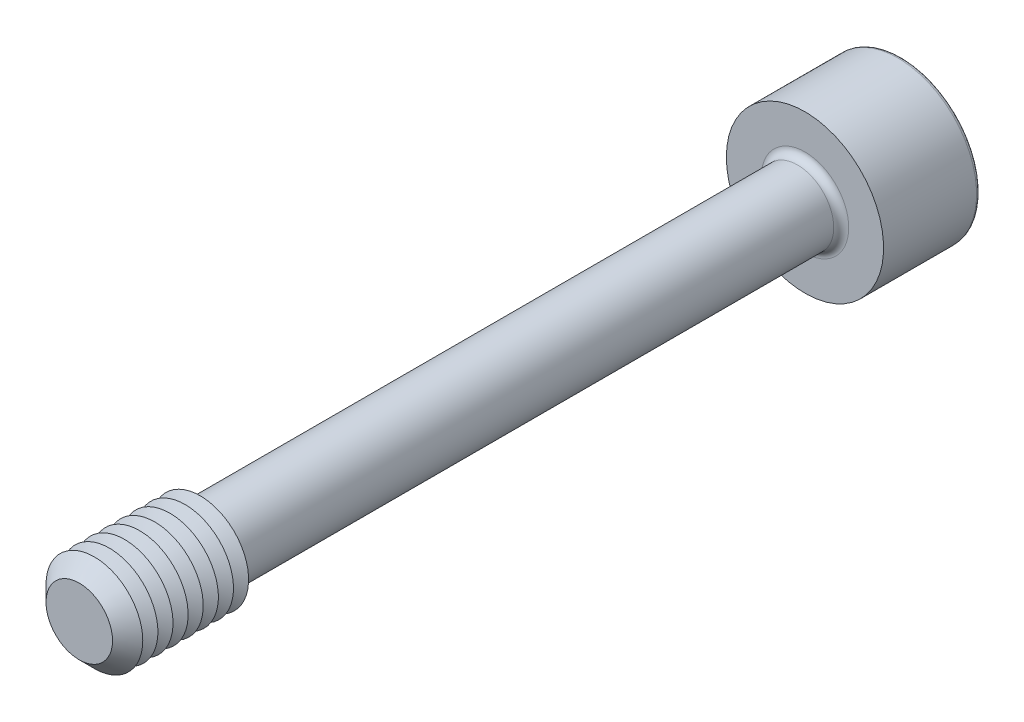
from build123d import *

# Parameters (mm, degrees)
SKETCH1_R       = 3
EXTRUDE1_DEPTH  = 30
CHAMFER1_SIZE   = 1.25
SKETCH3_R       = 6.5
EXTRUDE2_DEPTH  = 8
EXTRUDE3_DEPTH  = 6
FILLET1_R       = 0.62
FILLET2_R       = 0.31
LPATTERN1_COUNT = 7
LPATTERN1_PITCH = 1.25


with BuildPart() as part:
    # Sketch1 → Extrude1 (new, symmetric)
    with BuildSketch(Plane.XY):
        Circle(SKETCH1_R)
    extrude(amount=EXTRUDE1_DEPTH, both=True)

    # Sketch2 → Revolve1 (revolve)
    with BuildSketch(Plane(origin=(0, 0, 0), x_dir=(0, 0, -1), z_dir=(1, 0, 0))):
        Polygon((-30, 0), (-30, 4), (-20, 4), (-19.422649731, 3), (-19.422649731, 0), align=None)
    revolve(axis=Axis((0, 0, 19.422649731), (0, 0, 1)))

    # Chamfer1
    chamfer1_edges = [part.edges().sort_by_distance(p)[0] for p in [
        (0, -4, 30),
    ]]
    chamfer(chamfer1_edges, length=CHAMFER1_SIZE)

    # Sketch3 → Extrude2 (add)
    with BuildSketch(Plane(origin=(0, 0, -30), x_dir=(-1, 0, 0), z_dir=(0, 0, -1))):
        Circle(SKETCH3_R)
    extrude(amount=EXTRUDE2_DEPTH)

    # Sketch4 → Extrude3 (cut)
    with BuildSketch(Plane(origin=(-13.7, 0, -38), x_dir=(1, 0, 0), z_dir=(0, 0, 1))):
        Polygon((11.967949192, -3), (15.432050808, -3), (17.164101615, 0), (15.432050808, 3), (11.967949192, 3), (10.235898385, 0), align=None)
    extrude(amount=EXTRUDE3_DEPTH, mode=Mode.SUBTRACT)

    # Fillet1
    fillet1_edges = [part.edges().sort_by_distance(p)[0] for p in [
        (-3, 0, -30),
    ]]
    fillet(fillet1_edges, radius=FILLET1_R)

    # Fillet2
    fillet2_edges = [part.edges().sort_by_distance(p)[0] for p in [
        (6.5, 0, -38),
    ]]
    fillet(fillet2_edges, radius=FILLET2_R)

    # Sketch5 → Cut-Revolve1 (revolve, cut)
    with BuildSketch(Plane(origin=(0, 0, 0), x_dir=(0, 0, -1), z_dir=(1, 0, 0)), mode=Mode.PRIVATE) as cut_revolve1_sk:
        Polygon((32, 0), (32, -3), (30.267949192, 0), align=None)
    revolve(cut_revolve1_sk.sketch.rotate(Axis((0, 0, -30.267949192), (0, 0, -1)), 90), axis=Axis((0, 0, -30.267949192), (0, 0, -1)), mode=Mode.SUBTRACT)

    # Sketch7 → Cut-Revolve2 (revolve, cut)
    with BuildSketch(Plane(origin=(0, 0, 0), x_dir=(0, 0, -1), z_dir=(1, 0, 0)), mode=Mode.PRIVATE) as cut_revolve2_sk:
        Polygon((-20, 4), (-20.625, 2.917468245), (-21.25, 4), align=None)
    cut_revolve2 = revolve(cut_revolve2_sk.sketch.rotate(Axis((0, 0, -1.332048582), (0, 0, 1)), 90), axis=Axis((0, 0, -1.332048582), (0, 0, 1)), mode=Mode.SUBTRACT)

    # LPattern1: Cut-Revolve2 ×7
    with Locations(*[(0, 0, i * LPATTERN1_PITCH) for i in range(1, LPATTERN1_COUNT)]):
        add(cut_revolve2, mode=Mode.SUBTRACT)


solid = part.part
